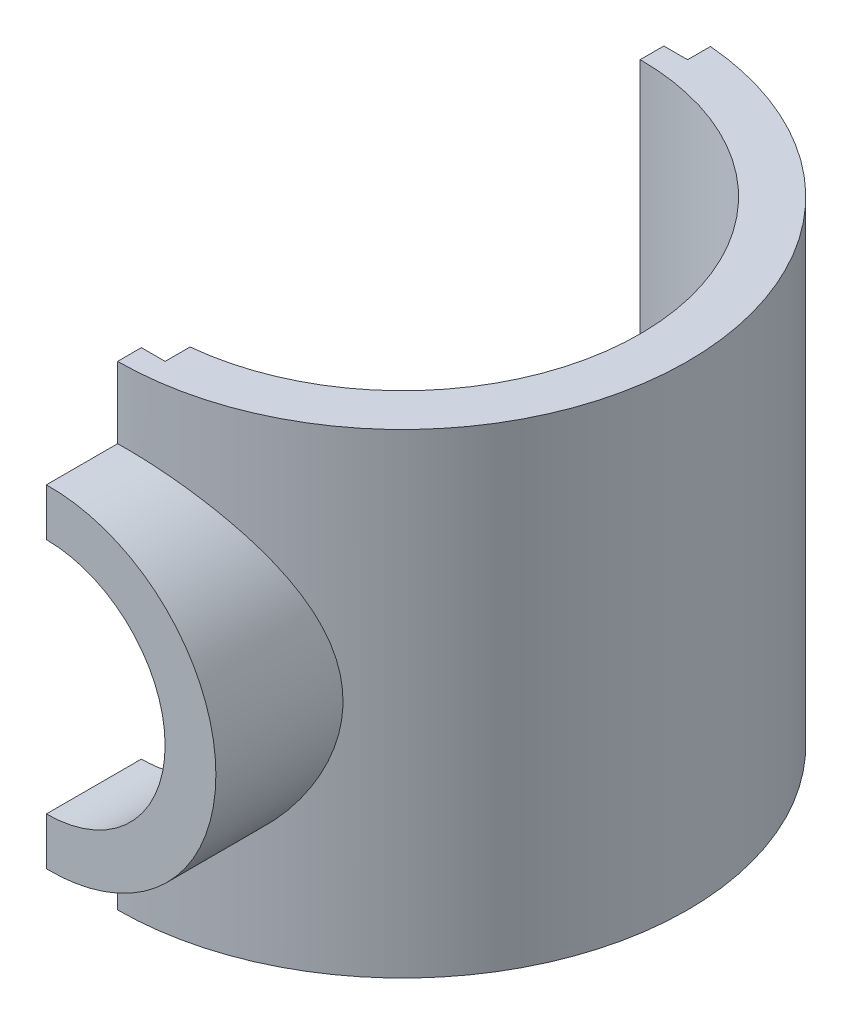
from build123d import *

# Parameters (mm, degrees)
BOSS_EXTRUDE1_DEPTH                  = 20
BOSS_EXTRUDE2_DEPTH                  = 3
BOSS_EXTRUDE2_DIRECTION_2_REACH      = 35.466
BOSS_EXTRUDE2_DIRECTION_2_END_RADIUS = 12
CUT_EXTRUDE1_START                   = -13
SKETCH4_R                            = 5
CUT_EXTRUDE1_DEPTH                   = 13
SKETCH5_W                            = 1.087571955
SKETCH5_H                            = 1.067208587
SKETCH5_W_2                          = 1.237061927
SKETCH5_H_2                          = 2
CUT_EXTRUDE5_DEPTH                   = 20


with BuildPart() as part:
    # Sketch1 → Boss-Extrude1 (new body)
    with BuildSketch(Plane(origin=(0, 0, 0), x_dir=(1, 0, 0), z_dir=(0, 1, 0))):
        with BuildLine():
            Line((0, 10), (0, 12))
            ThreePointArc((0, 12), (12, 0), (0, -12))
            Line((0, -12), (0, -10))
            ThreePointArc((0, -10), (10, 0), (0, 10))
        make_face()
    extrude(amount=BOSS_EXTRUDE1_DEPTH)

    # Sketch3 → Boss-Extrude2 (add)
    with BuildSketch(Plane.XY.offset(12)):
        with BuildLine():
            Line((0, 16.998648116), (0, 15))
            ThreePointArc((0, 15), (5, 10), (0, 5))
            Line((0, 5), (0, 3.001351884))
            ThreePointArc((0, 3.001351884), (7.137566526, 10), (0, 16.998648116))
        make_face()
    extrude(amount=BOSS_EXTRUDE2_DEPTH)

    # Boss-Extrude2 direction 2: up to this cylinder (the profile starts outside it)
    boss_extrude2_direction_2_end = Plane(origin=(0, 10, 0), z_dir=(0, -1, 0)) * Cylinder(BOSS_EXTRUDE2_DIRECTION_2_END_RADIUS, 95.932, mode=Mode.PRIVATE)
    # Sketch3 → Boss-Extrude2 direction 2 (add, up to the surface)
    with BuildSketch(Plane.XY.offset(12), mode=Mode.PRIVATE) as boss_extrude2_direction_2_sk1:
        with BuildLine():
            Line((0, 16.998648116), (0, 15))
            ThreePointArc((0, 15), (5, 10), (0, 5))
            Line((0, 5), (0, 3.001351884))
            ThreePointArc((0, 3.001351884), (7.137566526, 10), (0, 16.998648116))
        make_face()
    boss_extrude2_direction_2_tool1 = extrude(boss_extrude2_direction_2_sk1.sketch, amount=-BOSS_EXTRUDE2_DIRECTION_2_REACH, mode=Mode.PRIVATE) - boss_extrude2_direction_2_end
    add(boss_extrude2_direction_2_tool1.solids().sort_by_distance((6.980422, 10, 12))[0])

    # Sketch4 → Cut-Extrude1 (cut)
    with BuildSketch(Plane.XY.offset(12).offset(CUT_EXTRUDE1_START)):
        with Locations((0, 10)):
            Circle(SKETCH4_R)
    extrude(amount=CUT_EXTRUDE1_DEPTH, mode=Mode.SUBTRACT)

    # Sketch5 → Cut-Extrude5 (cut)
    with BuildSketch(Plane(origin=(0, 0, 0), x_dir=(1, 0, 0), z_dir=(0, 1, 0))):
        with Locations((0.456214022, 11.5287352)):
            Rectangle(SKETCH5_W, SKETCH5_H)
        with Locations((0.381469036, -9.999562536)):
            Rectangle(SKETCH5_W_2, SKETCH5_H_2)
    extrude(amount=CUT_EXTRUDE5_DEPTH, mode=Mode.SUBTRACT)


solid = part.part
